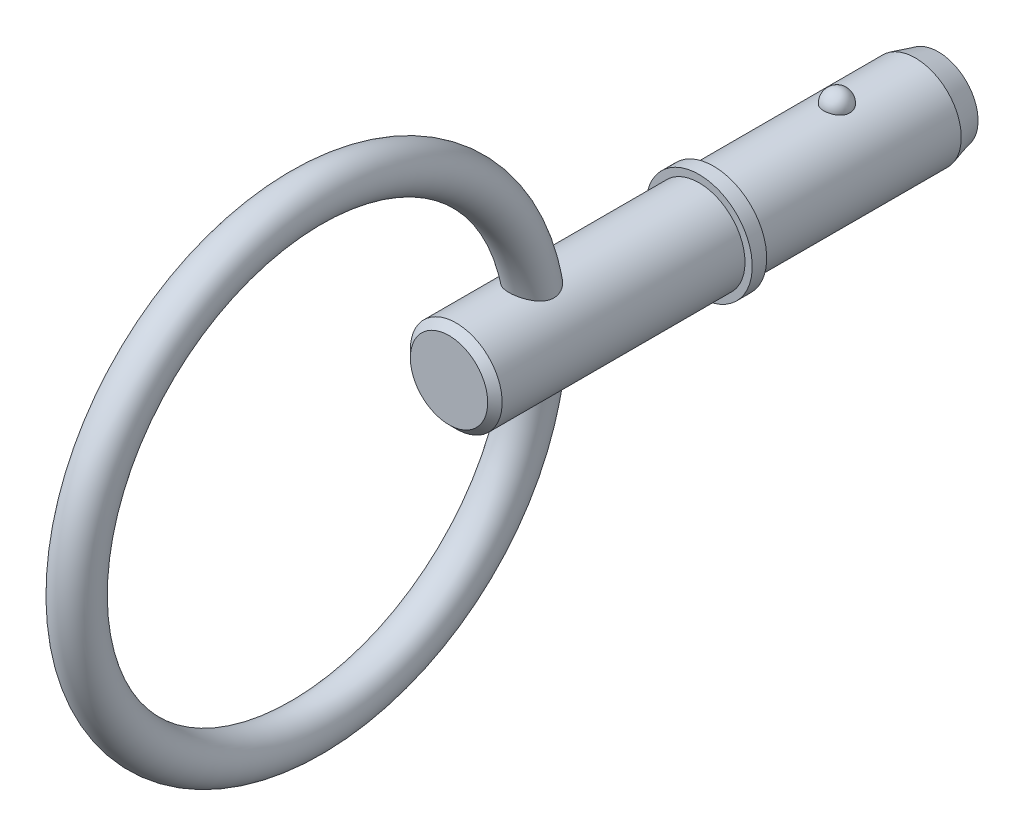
ISO-10303-21;
HEADER;
FILE_DESCRIPTION(('STEP AP214'),'2;1');
FILE_NAME('part.step','',(''),(''),'','','');
FILE_SCHEMA(('AUTOMOTIVE_DESIGN { 1 0 10303 214 1 1 1 1 }'));
ENDSEC;
DATA;
#1=APPLICATION_CONTEXT('core data for automotive mechanical design processes');
#2=APPLICATION_PROTOCOL_DEFINITION('international standard','automotive_design',2000,#1);
#3=PRODUCT_CONTEXT('',#1,'mechanical');
#4=PRODUCT('Part','Part','',(#3));
#5=PRODUCT_RELATED_PRODUCT_CATEGORY('part','',(#4));
#6=PRODUCT_DEFINITION_FORMATION('','',#4);
#7=PRODUCT_DEFINITION_CONTEXT('part definition',#1,'design');
#8=PRODUCT_DEFINITION('design','',#6,#7);
#9=PRODUCT_DEFINITION_SHAPE('','',#8);
#10=(LENGTH_UNIT() NAMED_UNIT(*) SI_UNIT(.MILLI.,.METRE.));
#11=(NAMED_UNIT(*) PLANE_ANGLE_UNIT() SI_UNIT($,.RADIAN.));
#12=(NAMED_UNIT(*) SI_UNIT($,.STERADIAN.) SOLID_ANGLE_UNIT());
#13=UNCERTAINTY_MEASURE_WITH_UNIT(LENGTH_MEASURE(1.E-05),#10,'distance_accuracy_value','');
#14=(GEOMETRIC_REPRESENTATION_CONTEXT(3) GLOBAL_UNCERTAINTY_ASSIGNED_CONTEXT((#13)) GLOBAL_UNIT_ASSIGNED_CONTEXT((#10,
#11,#12)) REPRESENTATION_CONTEXT('',''));
#15=CARTESIAN_POINT('',(0.,0.,0.));
#16=DIRECTION('',(0.,0.,1.));
#17=DIRECTION('',(1.,0.,0.));
#18=AXIS2_PLACEMENT_3D('',#15,#16,#17);
#19=CARTESIAN_POINT('',(0.,0.,7.62));
#20=DIRECTION('',(0.,0.,-1.));
#21=DIRECTION('',(-1.,0.,0.));
#22=AXIS2_PLACEMENT_3D('',#19,#20,#21);
#23=CYLINDRICAL_SURFACE('',#22,3.175);
#24=CARTESIAN_POINT('',(0.90060722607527,3.0445905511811,-0.910000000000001));
#25=CARTESIAN_POINT('',(0.90060646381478,3.04459122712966,-0.859144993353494));
#26=CARTESIAN_POINT('',(0.896466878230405,3.04582460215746,-0.808280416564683));
#27=CARTESIAN_POINT('',(0.88000740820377,3.05062019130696,-0.707994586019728));
#28=CARTESIAN_POINT('',(0.86768478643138,3.05418318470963,-0.658573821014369));
#29=CARTESIAN_POINT('',(0.835170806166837,3.06323316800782,-0.562604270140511));
#30=CARTESIAN_POINT('',(0.814982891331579,3.0687193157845,-0.516054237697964));
#31=CARTESIAN_POINT('',(0.767236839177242,3.08100268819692,-0.427093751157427));
#32=CARTESIAN_POINT('',(0.739678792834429,3.08779989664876,-0.384683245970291));
#33=CARTESIAN_POINT('',(0.677715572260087,3.10198953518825,-0.304951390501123));
#34=CARTESIAN_POINT('',(0.643275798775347,3.10938485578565,-0.267657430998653));
#35=CARTESIAN_POINT('',(0.568522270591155,3.12391647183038,-0.199446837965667));
#36=CARTESIAN_POINT('',(0.528208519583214,3.13105276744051,-0.168530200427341));
#37=CARTESIAN_POINT('',(0.442911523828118,3.14425008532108,-0.114021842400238));
#38=CARTESIAN_POINT('',(0.397942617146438,3.15031426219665,-0.0904084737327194));
#39=CARTESIAN_POINT('',(0.304493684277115,3.16071443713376,-0.051061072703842));
#40=CARTESIAN_POINT('',(0.256014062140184,3.1650506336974,-0.0353261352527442));
#41=CARTESIAN_POINT('',(0.15789136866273,3.17144549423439,-0.0124151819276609));
#42=CARTESIAN_POINT('',(0.108287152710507,3.1735453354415,-0.00508422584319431));
#43=CARTESIAN_POINT('',(0.0085070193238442,3.17538048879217,0.00133254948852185));
#44=CARTESIAN_POINT('',(-0.0416688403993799,3.17511603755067,0.000419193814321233));
#45=CARTESIAN_POINT('',(-0.140377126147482,3.17227395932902,-0.00954840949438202));
#46=CARTESIAN_POINT('',(-0.188922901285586,3.16973088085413,-0.0184810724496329));
#47=CARTESIAN_POINT('',(-0.283780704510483,3.16265029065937,-0.0440659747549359));
#48=CARTESIAN_POINT('',(-0.330092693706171,3.15811274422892,-0.0607183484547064));
#49=CARTESIAN_POINT('',(-0.419493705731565,3.1474895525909,-0.10140675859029));
#50=CARTESIAN_POINT('',(-0.462561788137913,3.14139480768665,-0.125486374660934));
#51=CARTESIAN_POINT('',(-0.54404237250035,3.12831396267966,-0.180346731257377));
#52=CARTESIAN_POINT('',(-0.582454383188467,3.12132776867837,-0.21112817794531));
#53=CARTESIAN_POINT('',(-0.654371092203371,3.10705591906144,-0.279257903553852));
#54=CARTESIAN_POINT('',(-0.687763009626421,3.09976707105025,-0.316724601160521));
#55=CARTESIAN_POINT('',(-0.747869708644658,3.08581767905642,-0.396782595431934));
#56=CARTESIAN_POINT('',(-0.774583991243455,3.07915718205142,-0.43937427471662));
#57=CARTESIAN_POINT('',(-0.820959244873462,3.06712152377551,-0.529074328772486));
#58=CARTESIAN_POINT('',(-0.840531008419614,3.06176288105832,-0.576231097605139));
#59=CARTESIAN_POINT('',(-0.871672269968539,3.0530437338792,-0.673291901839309));
#60=CARTESIAN_POINT('',(-0.883242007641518,3.04968316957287,-0.723195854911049));
#61=CARTESIAN_POINT('',(-0.898057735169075,3.04535343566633,-0.824104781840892));
#62=CARTESIAN_POINT('',(-0.901339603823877,3.04437395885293,-0.875104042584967));
#63=CARTESIAN_POINT('',(-0.89960137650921,3.04488803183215,-0.976947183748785));
#64=CARTESIAN_POINT('',(-0.894581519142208,3.04638151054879,-1.02779106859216));
#65=CARTESIAN_POINT('',(-0.876414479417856,3.051656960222,-1.12760218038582));
#66=CARTESIAN_POINT('',(-0.863310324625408,3.05542681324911,-1.17657789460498));
#67=CARTESIAN_POINT('',(-0.82933491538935,3.06482253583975,-1.27156757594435));
#68=CARTESIAN_POINT('',(-0.808463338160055,3.07044848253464,-1.31758141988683));
#69=CARTESIAN_POINT('',(-0.759325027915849,3.08296842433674,-1.40563218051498));
#70=CARTESIAN_POINT('',(-0.731017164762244,3.08986940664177,-1.44764515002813));
#71=CARTESIAN_POINT('',(-0.667767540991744,3.10415201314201,-1.52624913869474));
#72=CARTESIAN_POINT('',(-0.632825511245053,3.11153365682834,-1.56283993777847));
#73=CARTESIAN_POINT('',(-0.557049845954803,3.12598962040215,-1.62972906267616));
#74=CARTESIAN_POINT('',(-0.516193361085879,3.13306260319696,-1.66000181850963));
#75=CARTESIAN_POINT('',(-0.42979268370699,3.14607829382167,-1.7132172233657));
#76=CARTESIAN_POINT('',(-0.384248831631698,3.15202108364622,-1.73616040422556));
#77=CARTESIAN_POINT('',(-0.290370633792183,3.16204171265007,-1.77380927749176));
#78=CARTESIAN_POINT('',(-0.242079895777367,3.16614263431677,-1.7886174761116));
#79=CARTESIAN_POINT('',(-0.14357928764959,3.17213528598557,-1.81001390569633));
#80=CARTESIAN_POINT('',(-0.0933696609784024,3.1740272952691,-1.81660317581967));
#81=CARTESIAN_POINT('',(0.00648182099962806,3.17537830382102,-1.82132177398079));
#82=CARTESIAN_POINT('',(0.0561153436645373,3.17488455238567,-1.81961539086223));
#83=CARTESIAN_POINT('',(0.154368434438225,3.1716260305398,-1.80816900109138));
#84=CARTESIAN_POINT('',(0.202988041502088,3.16886134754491,-1.79842930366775));
#85=CARTESIAN_POINT('',(0.29764238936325,3.16137318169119,-1.77125024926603));
#86=CARTESIAN_POINT('',(0.343686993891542,3.15665785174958,-1.75384292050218));
#87=CARTESIAN_POINT('',(0.432167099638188,3.14576631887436,-1.71181408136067));
#88=CARTESIAN_POINT('',(0.474602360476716,3.13959001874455,-1.68719209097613));
#89=CARTESIAN_POINT('',(0.555408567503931,3.1263159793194,-1.63094218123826));
#90=CARTESIAN_POINT('',(0.593703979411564,3.11920512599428,-1.59920888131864));
#91=CARTESIAN_POINT('',(0.664472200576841,3.10490064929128,-1.52981493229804));
#92=CARTESIAN_POINT('',(0.696944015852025,3.09770701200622,-1.49215327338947));
#93=CARTESIAN_POINT('',(0.755798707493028,3.08388169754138,-1.41116434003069));
#94=CARTESIAN_POINT('',(0.782059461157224,3.07726269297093,-1.36774610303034));
#95=CARTESIAN_POINT('',(0.827051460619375,3.06547790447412,-1.27699966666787));
#96=CARTESIAN_POINT('',(0.845785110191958,3.06031165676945,-1.22967272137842));
#97=CARTESIAN_POINT('',(0.873798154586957,3.05242388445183,-1.13728658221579));
#98=CARTESIAN_POINT('',(0.883833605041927,3.04951005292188,-1.09247132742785));
#99=CARTESIAN_POINT('',(0.897238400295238,3.0455931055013,-1.00177329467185));
#100=CARTESIAN_POINT('',(0.900607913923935,3.0445899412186,-0.955890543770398));
#101=CARTESIAN_POINT('',(0.90060722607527,3.0445905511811,-0.910000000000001));
#102=B_SPLINE_CURVE_WITH_KNOTS('',3,(#24,#25,#26,#27,#28,#29,#30,#31,#32,#33,#34,#35,#36,#37,
#38,#39,#40,#41,#42,#43,#44,#45,#46,#47,#48,#49,#50,#51,#52,#53,#54,#55,#56,#57,#58,#59,#60,#61,
#62,#63,#64,#65,#66,#67,#68,#69,#70,#71,#72,#73,#74,#75,#76,#77,#78,#79,#80,#81,#82,#83,#84,#85,
#86,#87,#88,#89,#90,#91,#92,#93,#94,#95,#96,#97,#98,#99,#100,#101),.UNSPECIFIED.,.T.,.F.,(4,2,2,
2,2,2,2,2,2,2,2,2,2,2,2,2,2,2,2,2,2,2,2,2,2,2,2,2,2,2,2,2,2,2,2,2,2,2,4),(0.,0.152400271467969,
0.304851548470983,0.45723615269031,0.609618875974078,0.762787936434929,0.915956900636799,
1.06866739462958,1.22136034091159,1.37119044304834,1.52100555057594,1.66858689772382,
1.81617081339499,1.9646377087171,2.1131202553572,2.26455561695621,2.41600229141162,
2.5692805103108,2.72255413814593,2.87516308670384,3.02776764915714,3.1795669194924,
3.33137249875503,3.48403607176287,3.63670583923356,3.78998198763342,3.94324701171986,
4.09453370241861,4.24580126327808,4.39408543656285,4.5423639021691,4.69002878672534,
4.83770349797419,4.9877312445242,5.13778457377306,5.29058018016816,5.44332695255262,
5.58085340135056,5.71837636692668),.UNSPECIFIED.);
#103=CARTESIAN_POINT('',(0.90060722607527,3.0445905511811,-0.910000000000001));
#104=VERTEX_POINT('',#103);
#105=EDGE_CURVE('E102',#104,#104,#102,.T.);
#106=ORIENTED_EDGE('',*,*,#105,.T.);
#107=EDGE_LOOP('',(#106));
#108=FACE_BOUND('',#107,.T.);
#109=CARTESIAN_POINT('',(0.,0.,-6.33399999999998));
#110=DIRECTION('',(0.,0.,-1.));
#111=DIRECTION('',(-1.,0.,0.));
#112=AXIS2_PLACEMENT_3D('',#109,#110,#111);
#113=CIRCLE('',#112,3.175);
#114=CARTESIAN_POINT('',(-3.175,0.,-6.33399999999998));
#115=VERTEX_POINT('',#114);
#116=EDGE_CURVE('E109',#115,#115,#113,.F.);
#117=ORIENTED_EDGE('',*,*,#116,.T.);
#118=EDGE_LOOP('',(#117));
#119=FACE_BOUND('',#118,.T.);
#120=CARTESIAN_POINT('',(0.,0.,7.62));
#121=DIRECTION('',(0.,0.,1.));
#122=DIRECTION('',(1.,0.,0.));
#123=AXIS2_PLACEMENT_3D('',#120,#121,#122);
#124=CIRCLE('',#123,3.175);
#125=CARTESIAN_POINT('',(3.175,0.,7.62));
#126=VERTEX_POINT('',#125);
#127=EDGE_CURVE('E107',#126,#126,#124,.T.);
#128=ORIENTED_EDGE('',*,*,#127,.F.);
#129=EDGE_LOOP('',(#128));
#130=FACE_BOUND('',#129,.T.);
#131=ADVANCED_FACE('F39',(#108,#119,#130),#23,.T.);
#132=CARTESIAN_POINT('',(0.,0.,-7.92));
#133=DIRECTION('',(0.,0.,-1.));
#134=DIRECTION('',(-1.,0.,0.));
#135=AXIS2_PLACEMENT_3D('',#132,#133,#134);
#136=PLANE('',#135);
#137=CARTESIAN_POINT('',(0.,0.,-7.92));
#138=DIRECTION('',(0.,0.,-1.));
#139=DIRECTION('',(-1.,0.,0.));
#140=AXIS2_PLACEMENT_3D('',#137,#138,#139);
#141=CIRCLE('',#140,2.75003258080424);
#142=CARTESIAN_POINT('',(-2.75003258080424,0.,-7.92));
#143=VERTEX_POINT('',#142);
#144=EDGE_CURVE('E142',#143,#143,#141,.T.);
#145=ORIENTED_EDGE('',*,*,#144,.T.);
#146=EDGE_LOOP('',(#145));
#147=FACE_BOUND('',#146,.T.);
#148=ADVANCED_FACE('F88',(#147),#136,.T.);
#149=CARTESIAN_POINT('',(0.,0.,-7.92));
#150=DIRECTION('',(0.,0.,1.));
#151=DIRECTION('',(1.,0.,0.));
#152=AXIS2_PLACEMENT_3D('',#149,#150,#151);
#153=CONICAL_SURFACE('',#152,2.75003258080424,0.261799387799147);
#154=ORIENTED_EDGE('',*,*,#116,.F.);
#155=EDGE_LOOP('',(#154));
#156=FACE_BOUND('',#155,.T.);
#157=ORIENTED_EDGE('',*,*,#144,.F.);
#158=EDGE_LOOP('',(#157));
#159=FACE_BOUND('',#158,.T.);
#160=ADVANCED_FACE('F94',(#156,#159),#153,.T.);
#161=CARTESIAN_POINT('',(0.,3.175,-0.910000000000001));
#162=DIRECTION('',(0.,1.,0.));
#163=DIRECTION('',(0.,0.,-1.));
#164=AXIS2_PLACEMENT_3D('',#161,#162,#163);
#165=SPHERICAL_SURFACE('',#164,0.91);
#166=ORIENTED_EDGE('',*,*,#105,.F.);
#167=EDGE_LOOP('',(#166));
#168=FACE_BOUND('',#167,.T.);
#169=ADVANCED_FACE('F112',(#168),#165,.T.);
#170=CARTESIAN_POINT('',(0.,0.,7.62));
#171=DIRECTION('',(0.,0.,-1.));
#172=DIRECTION('',(-1.,0.,0.));
#173=AXIS2_PLACEMENT_3D('',#170,#171,#172);
#174=PLANE('',#173);
#175=ORIENTED_EDGE('',*,*,#127,.T.);
#176=EDGE_LOOP('',(#175));
#177=FACE_BOUND('',#176,.T.);
#178=CARTESIAN_POINT('',(0.,0.,7.62));
#179=DIRECTION('',(0.,0.,-1.));
#180=DIRECTION('',(-1.,0.,0.));
#181=AXIS2_PLACEMENT_3D('',#178,#179,#180);
#182=CIRCLE('',#181,3.675);
#183=CARTESIAN_POINT('',(-3.675,0.,7.62));
#184=VERTEX_POINT('',#183);
#185=EDGE_CURVE('E108',#184,#184,#182,.T.);
#186=ORIENTED_EDGE('',*,*,#185,.T.);
#187=EDGE_LOOP('',(#186));
#188=FACE_BOUND('',#187,.T.);
#189=ADVANCED_FACE('F116',(#177,#188),#174,.T.);
#190=CARTESIAN_POINT('',(0.,0.,33.7287874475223));
#191=DIRECTION('',(0.,0.,-1.));
#192=DIRECTION('',(-1.,0.,0.));
#193=AXIS2_PLACEMENT_3D('',#190,#191,#192);
#194=CYLINDRICAL_SURFACE('',#193,3.675);
#195=CARTESIAN_POINT('',(0.,0.,8.62));
#196=DIRECTION('',(0.,0.,-1.));
#197=DIRECTION('',(-1.,0.,0.));
#198=AXIS2_PLACEMENT_3D('',#195,#196,#197);
#199=CIRCLE('',#198,3.675);
#200=CARTESIAN_POINT('',(-3.675,0.,8.62));
#201=VERTEX_POINT('',#200);
#202=EDGE_CURVE('E133',#201,#201,#199,.T.);
#203=ORIENTED_EDGE('',*,*,#202,.T.);
#204=EDGE_LOOP('',(#203));
#205=FACE_BOUND('',#204,.T.);
#206=ORIENTED_EDGE('',*,*,#185,.F.);
#207=EDGE_LOOP('',(#206));
#208=FACE_BOUND('',#207,.T.);
#209=ADVANCED_FACE('F120',(#205,#208),#194,.T.);
#210=CARTESIAN_POINT('',(0.,3.675,8.62));
#211=DIRECTION('',(0.,0.,1.));
#212=DIRECTION('',(1.,0.,0.));
#213=AXIS2_PLACEMENT_3D('',#210,#211,#212);
#214=PLANE('',#213);
#215=CARTESIAN_POINT('',(0.,0.,8.62));
#216=DIRECTION('',(0.,0.,1.));
#217=DIRECTION('',(1.,0.,0.));
#218=AXIS2_PLACEMENT_3D('',#215,#216,#217);
#219=CIRCLE('',#218,3.175);
#220=CARTESIAN_POINT('',(3.175,0.,8.62));
#221=VERTEX_POINT('',#220);
#222=EDGE_CURVE('E111',#221,#221,#219,.T.);
#223=ORIENTED_EDGE('',*,*,#222,.F.);
#224=EDGE_LOOP('',(#223));
#225=FACE_BOUND('',#224,.T.);
#226=ORIENTED_EDGE('',*,*,#202,.F.);
#227=EDGE_LOOP('',(#226));
#228=FACE_BOUND('',#227,.T.);
#229=ADVANCED_FACE('F85',(#225,#228),#214,.T.);
#230=CARTESIAN_POINT('',(0.,0.,25.91));
#231=DIRECTION('',(0.,0.,-1.));
#232=DIRECTION('',(-1.,0.,0.));
#233=AXIS2_PLACEMENT_3D('',#230,#231,#232);
#234=CYLINDRICAL_SURFACE('',#233,3.175);
#235=CARTESIAN_POINT('',(-0.793622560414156,-3.07421343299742,18.9149618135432));
#236=CARTESIAN_POINT('',(-0.723928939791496,-3.09220199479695,18.8740743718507));
#237=CARTESIAN_POINT('',(-0.65053758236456,-3.10860299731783,18.8386572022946));
#238=CARTESIAN_POINT('',(-0.498225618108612,-3.13662262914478,18.77960803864));
#239=CARTESIAN_POINT('',(-0.419299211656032,-3.14823615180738,18.755988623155));
#240=CARTESIAN_POINT('',(-0.258022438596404,-3.16553731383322,18.7211787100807));
#241=CARTESIAN_POINT('',(-0.17566885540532,-3.17121924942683,18.7100001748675));
#242=CARTESIAN_POINT('',(-0.0100583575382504,-3.17606405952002,18.7004538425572));
#243=CARTESIAN_POINT('',(0.073198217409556,-3.17522930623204,18.7020813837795));
#244=CARTESIAN_POINT('',(0.236345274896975,-3.16722178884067,18.7179075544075));
#245=CARTESIAN_POINT('',(0.316269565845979,-3.16018772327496,18.7318310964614));
#246=CARTESIAN_POINT('',(0.472429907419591,-3.14064183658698,18.7714871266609));
#247=CARTESIAN_POINT('',(0.548665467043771,-3.12812928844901,18.7972211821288));
#248=CARTESIAN_POINT('',(0.696533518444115,-3.0985857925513,18.8603145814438));
#249=CARTESIAN_POINT('',(0.768085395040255,-3.08149328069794,18.8978336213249));
#250=CARTESIAN_POINT('',(0.903666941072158,-3.04449595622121,18.983584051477));
#251=CARTESIAN_POINT('',(0.967693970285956,-3.02459016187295,19.0318191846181));
#252=CARTESIAN_POINT('',(1.08889306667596,-2.98315111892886,19.140085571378));
#253=CARTESIAN_POINT('',(1.14572430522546,-2.96158491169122,19.2004869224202));
#254=CARTESIAN_POINT('',(1.24806454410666,-2.91993487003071,19.3306874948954));
#255=CARTESIAN_POINT('',(1.29357550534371,-2.89985077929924,19.4004850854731));
#256=CARTESIAN_POINT('',(1.37094214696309,-2.86407549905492,19.5462600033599));
#257=CARTESIAN_POINT('',(1.40307792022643,-2.84829687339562,19.6220662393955));
#258=CARTESIAN_POINT('',(1.45397574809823,-2.82265933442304,19.7789553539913));
#259=CARTESIAN_POINT('',(1.47274938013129,-2.81279529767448,19.8600335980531));
#260=CARTESIAN_POINT('',(1.49549698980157,-2.80076108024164,20.0179026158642));
#261=CARTESIAN_POINT('',(1.50056337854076,-2.79802369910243,20.0944958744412));
#262=CARTESIAN_POINT('',(1.49933665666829,-2.79868066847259,20.2475541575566));
#263=CARTESIAN_POINT('',(1.49304097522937,-2.80207640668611,20.3240191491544));
#264=CARTESIAN_POINT('',(1.46976618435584,-2.81435249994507,20.4752802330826));
#265=CARTESIAN_POINT('',(1.45272287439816,-2.82326580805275,20.5500634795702));
#266=CARTESIAN_POINT('',(1.40884990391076,-2.84541139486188,20.6960088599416));
#267=CARTESIAN_POINT('',(1.38201642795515,-2.85864535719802,20.7671695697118));
#268=CARTESIAN_POINT('',(1.31496449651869,-2.89016475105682,20.9146079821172));
#269=CARTESIAN_POINT('',(1.27338339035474,-2.90890132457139,20.9901693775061));
#270=CARTESIAN_POINT('',(1.17952729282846,-2.94820796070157,21.1339034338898));
#271=CARTESIAN_POINT('',(1.12723913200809,-2.96878026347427,21.2020668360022));
#272=CARTESIAN_POINT('',(1.00570728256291,-3.01228109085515,21.3373106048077));
#273=CARTESIAN_POINT('',(0.935174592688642,-3.03519170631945,21.4032498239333));
#274=CARTESIAN_POINT('',(0.782605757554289,-3.07805054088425,21.521321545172));
#275=CARTESIAN_POINT('',(0.700588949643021,-3.09800362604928,21.5734768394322));
#276=CARTESIAN_POINT('',(0.549003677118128,-3.12787153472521,21.6496423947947));
#277=CARTESIAN_POINT('',(0.48158225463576,-3.1390487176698,21.6774376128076));
#278=CARTESIAN_POINT('',(0.34269622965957,-3.15722518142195,21.7221563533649));
#279=CARTESIAN_POINT('',(0.271235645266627,-3.16422853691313,21.7390904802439));
#280=CARTESIAN_POINT('',(0.125873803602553,-3.17334230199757,21.7610622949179));
#281=CARTESIAN_POINT('',(0.0519637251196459,-3.17543249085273,21.7660508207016));
#282=CARTESIAN_POINT('',(-0.0956207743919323,-3.17441743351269,21.7636180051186));
#283=CARTESIAN_POINT('',(-0.16929518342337,-3.1713119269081,21.7561960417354));
#284=CARTESIAN_POINT('',(-0.30944934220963,-3.1606169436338,21.7303375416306));
#285=CARTESIAN_POINT('',(-0.376089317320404,-3.15332372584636,21.7126279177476));
#286=CARTESIAN_POINT('',(-0.505583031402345,-3.13517004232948,21.6677876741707));
#287=CARTESIAN_POINT('',(-0.568435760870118,-3.12430863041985,21.6406545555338));
#288=CARTESIAN_POINT('',(-0.694306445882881,-3.09887452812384,21.5755626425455));
#289=CARTESIAN_POINT('',(-0.756907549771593,-3.08406907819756,21.5368937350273));
#290=CARTESIAN_POINT('',(-0.8756456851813,-3.05248288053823,21.4513455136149));
#291=CARTESIAN_POINT('',(-0.931779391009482,-3.03570112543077,21.4044620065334));
#292=CARTESIAN_POINT('',(-1.0463923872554,-2.99832170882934,21.2947926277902));
#293=CARTESIAN_POINT('',(-1.10353654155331,-2.97757338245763,21.2306605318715));
#294=CARTESIAN_POINT('',(-1.20755858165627,-2.93692907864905,21.0942268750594));
#295=CARTESIAN_POINT('',(-1.25442453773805,-2.91703411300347,21.0219159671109));
#296=CARTESIAN_POINT('',(-1.34199791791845,-2.87788786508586,20.8612794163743));
#297=CARTESIAN_POINT('',(-1.38127718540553,-2.8590047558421,20.7720744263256));
#298=CARTESIAN_POINT('',(-1.44406659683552,-2.82781619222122,20.5871839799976));
#299=CARTESIAN_POINT('',(-1.46759319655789,-2.81550387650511,20.4915054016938));
#300=CARTESIAN_POINT('',(-1.49571801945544,-2.8006591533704,20.3045771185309));
#301=CARTESIAN_POINT('',(-1.50169726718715,-2.79741422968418,20.213598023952));
#302=CARTESIAN_POINT('',(-1.49747735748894,-2.79967890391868,20.0321564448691));
#303=CARTESIAN_POINT('',(-1.48729863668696,-2.80517744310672,19.9416934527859));
#304=CARTESIAN_POINT('',(-1.45348639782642,-2.82281521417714,19.7784626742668));
#305=CARTESIAN_POINT('',(-1.43212237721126,-2.83382344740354,19.705088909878));
#306=CARTESIAN_POINT('',(-1.37828411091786,-2.86039426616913,19.5633903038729));
#307=CARTESIAN_POINT('',(-1.34580440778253,-2.87595908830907,19.4950679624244));
#308=CARTESIAN_POINT('',(-1.27066760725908,-2.90993532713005,19.3650336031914));
#309=CARTESIAN_POINT('',(-1.22800357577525,-2.9283486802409,19.303326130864));
#310=CARTESIAN_POINT('',(-1.13363307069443,-2.96615489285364,19.1877083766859));
#311=CARTESIAN_POINT('',(-1.08193541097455,-2.98554678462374,19.1337905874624));
#312=CARTESIAN_POINT('',(-0.990573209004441,-3.01675653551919,19.0523094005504));
#313=CARTESIAN_POINT('',(-0.953209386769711,-3.02880489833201,19.0222130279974));
#314=CARTESIAN_POINT('',(-0.875544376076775,-3.05216210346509,18.9657477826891));
#315=CARTESIAN_POINT('',(-0.835242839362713,-3.06347085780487,18.9393793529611));
#316=CARTESIAN_POINT('',(-0.793622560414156,-3.07421343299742,18.9149618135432));
#317=B_SPLINE_CURVE_WITH_KNOTS('',3,(#235,#236,#237,#238,#239,#240,#241,#242,#243,#244,#245,
#246,#247,#248,#249,#250,#251,#252,#253,#254,#255,#256,#257,#258,#259,#260,#261,#262,#263,#264,
#265,#266,#267,#268,#269,#270,#271,#272,#273,#274,#275,#276,#277,#278,#279,#280,#281,#282,#283,
#284,#285,#286,#287,#288,#289,#290,#291,#292,#293,#294,#295,#296,#297,#298,#299,#300,#301,#302,
#303,#304,#305,#306,#307,#308,#309,#310,#311,#312,#313,#314,#315,#316),.UNSPECIFIED.,.T.,.F.,(4,
2,2,2,2,2,2,2,2,2,2,2,2,2,2,2,2,2,2,2,2,2,2,2,2,2,2,2,2,2,2,2,2,2,2,2,2,2,2,2,4),(0.,
0.248167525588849,0.496599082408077,0.745269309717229,0.993849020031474,1.23700449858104,
1.48019225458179,1.72682894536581,1.97355191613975,2.22939388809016,2.48519151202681,
2.73532416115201,2.98523982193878,3.21455414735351,3.4439203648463,3.67466984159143,
3.90550934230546,4.16925064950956,4.43331832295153,4.72951976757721,5.02522832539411,
5.24564983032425,5.46585579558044,5.68696647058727,5.9080882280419,6.11521387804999,
6.32239449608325,6.54672206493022,6.77116447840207,7.03522663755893,7.29959368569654,
7.59590092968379,7.89189815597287,8.16387683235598,8.43551178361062,8.66603557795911,
8.89667271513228,9.12746733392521,9.35803801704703,9.5062233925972,9.65442636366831),.UNSPECIFIED.);
#318=CARTESIAN_POINT('',(-0.793622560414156,-3.07421343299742,18.9149618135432));
#319=VERTEX_POINT('',#318);
#320=EDGE_CURVE('E10',#319,#319,#317,.T.);
#321=ORIENTED_EDGE('',*,*,#320,.F.);
#322=EDGE_LOOP('',(#321));
#323=FACE_BOUND('',#322,.T.);
#324=CARTESIAN_POINT('',(-0.793622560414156,3.07421343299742,18.9149618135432));
#325=CARTESIAN_POINT('',(-0.864606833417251,3.05588589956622,18.9566128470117));
#326=CARTESIAN_POINT('',(-0.931875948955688,3.03587991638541,19.0040114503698));
#327=CARTESIAN_POINT('',(-1.05725170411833,2.99453227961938,19.1093775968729));
#328=CARTESIAN_POINT('',(-1.11534118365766,2.97318822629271,19.1673645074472));
#329=CARTESIAN_POINT('',(-1.22080462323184,2.93146441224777,19.292887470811));
#330=CARTESIAN_POINT('',(-1.26816209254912,2.91108617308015,19.3604379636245));
#331=CARTESIAN_POINT('',(-1.35052787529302,2.87380473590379,19.5035086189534));
#332=CARTESIAN_POINT('',(-1.38554886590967,2.856897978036,19.5790204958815));
#333=CARTESIAN_POINT('',(-1.44074287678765,2.82945202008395,19.7322947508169));
#334=CARTESIAN_POINT('',(-1.46153301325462,2.81865228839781,19.8097872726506));
#335=CARTESIAN_POINT('',(-1.49023441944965,2.80358650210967,19.9677206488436));
#336=CARTESIAN_POINT('',(-1.49815016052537,2.79931817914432,20.0481604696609));
#337=CARTESIAN_POINT('',(-1.50117056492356,2.79769676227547,20.2040076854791));
#338=CARTESIAN_POINT('',(-1.49708260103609,2.79990784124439,20.2793985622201));
#339=CARTESIAN_POINT('',(-1.47846985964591,2.80977909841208,20.4284983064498));
#340=CARTESIAN_POINT('',(-1.46394166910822,2.8174410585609,20.5022066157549));
#341=CARTESIAN_POINT('',(-1.42400377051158,2.83784609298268,20.6513443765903));
#342=CARTESIAN_POINT('',(-1.39791960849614,2.85090002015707,20.7265484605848));
#343=CARTESIAN_POINT('',(-1.33585690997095,2.8805017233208,20.8720384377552));
#344=CARTESIAN_POINT('',(-1.29987052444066,2.89705226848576,20.9423203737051));
#345=CARTESIAN_POINT('',(-1.21229019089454,2.93489412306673,21.0877405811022));
#346=CARTESIAN_POINT('',(-1.15911759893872,2.95651988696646,21.1618449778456));
#347=CARTESIAN_POINT('',(-1.04143166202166,2.99999612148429,21.3003805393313));
#348=CARTESIAN_POINT('',(-0.976918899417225,3.0218465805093,21.364812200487));
#349=CARTESIAN_POINT('',(-0.845368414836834,3.06106710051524,21.4752302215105));
#350=CARTESIAN_POINT('',(-0.779466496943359,3.0786636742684,21.5224840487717));
#351=CARTESIAN_POINT('',(-0.640261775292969,3.11059085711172,21.6059540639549));
#352=CARTESIAN_POINT('',(-0.566963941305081,3.12492363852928,21.6421775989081));
#353=CARTESIAN_POINT('',(-0.413802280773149,3.14887886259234,21.7018109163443));
#354=CARTESIAN_POINT('',(-0.333888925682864,3.15846114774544,21.7251116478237));
#355=CARTESIAN_POINT('',(-0.17066058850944,3.17146222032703,21.7565717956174));
#356=CARTESIAN_POINT('',(-0.087349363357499,3.17488763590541,21.7647474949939));
#357=CARTESIAN_POINT('',(0.0674621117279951,3.17509166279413,21.7652317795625));
#358=CARTESIAN_POINT('',(0.138963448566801,3.17274321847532,21.7596242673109));
#359=CARTESIAN_POINT('',(0.279855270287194,3.16342998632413,21.7371581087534));
#360=CARTESIAN_POINT('',(0.349245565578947,3.15646478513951,21.7202984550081));
#361=CARTESIAN_POINT('',(0.483013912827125,3.13875920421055,21.6767119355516));
#362=CARTESIAN_POINT('',(0.547455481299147,3.12808257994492,21.6501513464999));
#363=CARTESIAN_POINT('',(0.671431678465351,3.10383639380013,21.5883782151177));
#364=CARTESIAN_POINT('',(0.730964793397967,3.09026594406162,21.5531630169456));
#365=CARTESIAN_POINT('',(0.852308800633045,3.05919023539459,21.4698716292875));
#366=CARTESIAN_POINT('',(0.913284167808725,3.04140021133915,21.4206877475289));
#367=CARTESIAN_POINT('',(1.0273242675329,3.00480015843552,21.3141850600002));
#368=CARTESIAN_POINT('',(1.08038247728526,2.98598930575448,21.2568596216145));
#369=CARTESIAN_POINT('',(1.18657794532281,2.94557646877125,21.1246952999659));
#370=CARTESIAN_POINT('',(1.23812372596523,2.92405810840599,21.0485445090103));
#371=CARTESIAN_POINT('',(1.32862928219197,2.88406370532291,20.8882796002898));
#372=CARTESIAN_POINT('',(1.36758013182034,2.86558982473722,20.8041598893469));
#373=CARTESIAN_POINT('',(1.43274280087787,2.83359383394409,20.6261421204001));
#374=CARTESIAN_POINT('',(1.45837682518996,2.82030175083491,20.5319863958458));
#375=CARTESIAN_POINT('',(1.49241322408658,2.80245006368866,20.3398495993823));
#376=CARTESIAN_POINT('',(1.50084951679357,2.79787327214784,20.2418764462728));
#377=CARTESIAN_POINT('',(1.49914798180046,2.79877932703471,20.0605073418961));
#378=CARTESIAN_POINT('',(1.49154990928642,2.80288682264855,19.977078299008));
#379=CARTESIAN_POINT('',(1.4625313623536,2.81813655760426,19.8133228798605));
#380=CARTESIAN_POINT('',(1.44111368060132,2.82927737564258,19.7329958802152));
#381=CARTESIAN_POINT('',(1.38785163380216,2.85574398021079,19.5857200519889));
#382=CARTESIAN_POINT('',(1.3572264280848,2.87055627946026,19.5182302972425));
#383=CARTESIAN_POINT('',(1.28612163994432,2.90310901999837,19.3894446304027));
#384=CARTESIAN_POINT('',(1.24564038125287,2.92084995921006,19.328149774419));
#385=CARTESIAN_POINT('',(1.1532082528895,2.95860856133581,19.2094756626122));
#386=CARTESIAN_POINT('',(1.10072548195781,2.97869868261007,19.1525343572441));
#387=CARTESIAN_POINT('',(0.987118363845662,3.01825121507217,19.0477702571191));
#388=CARTESIAN_POINT('',(0.925990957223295,3.03771340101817,18.9999507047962));
#389=CARTESIAN_POINT('',(0.792065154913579,3.07545294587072,18.9113571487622));
#390=CARTESIAN_POINT('',(0.718757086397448,3.0935612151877,18.8712781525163));
#391=CARTESIAN_POINT('',(0.565747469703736,3.12516438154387,18.8033730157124));
#392=CARTESIAN_POINT('',(0.486046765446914,3.13865988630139,18.7755452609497));
#393=CARTESIAN_POINT('',(0.323293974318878,3.15955163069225,18.7330890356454));
#394=CARTESIAN_POINT('',(0.240283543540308,3.16700771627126,18.7183309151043));
#395=CARTESIAN_POINT('',(0.0726303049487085,3.17527774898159,18.7019853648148));
#396=CARTESIAN_POINT('',(-0.0120126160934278,3.17609123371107,18.7003988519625));
#397=CARTESIAN_POINT('',(-0.177340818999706,3.17108555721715,18.7102649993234));
#398=CARTESIAN_POINT('',(-0.258061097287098,3.16549698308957,18.7212643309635));
#399=CARTESIAN_POINT('',(-0.416230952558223,3.1486007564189,18.7552506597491));
#400=CARTESIAN_POINT('',(-0.493684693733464,3.13730063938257,18.7782218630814));
#401=CARTESIAN_POINT('',(-0.607599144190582,3.11657538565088,18.8218364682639));
#402=CARTESIAN_POINT('',(-0.645999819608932,3.10882447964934,18.8383691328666));
#403=CARTESIAN_POINT('',(-0.721122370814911,3.092262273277,18.8744352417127));
#404=CARTESIAN_POINT('',(-0.757844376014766,3.08345105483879,18.8939684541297));
#405=CARTESIAN_POINT('',(-0.793622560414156,3.07421343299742,18.9149618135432));
#406=B_SPLINE_CURVE_WITH_KNOTS('',3,(#324,#325,#326,#327,#328,#329,#330,#331,#332,#333,#334,
#335,#336,#337,#338,#339,#340,#341,#342,#343,#344,#345,#346,#347,#348,#349,#350,#351,#352,#353,
#354,#355,#356,#357,#358,#359,#360,#361,#362,#363,#364,#365,#366,#367,#368,#369,#370,#371,#372,
#373,#374,#375,#376,#377,#378,#379,#380,#381,#382,#383,#384,#385,#386,#387,#388,#389,#390,#391,
#392,#393,#394,#395,#396,#397,#398,#399,#400,#401,#402,#403,#404,#405),.UNSPECIFIED.,.T.,.F.,(4,
2,2,2,2,2,2,2,2,2,2,2,2,2,2,2,2,2,2,2,2,2,2,2,2,2,2,2,2,2,2,2,2,2,2,2,2,2,2,2,4),(0.,
0.252800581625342,0.506068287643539,0.759722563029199,1.01311541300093,1.25467278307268,
1.49614624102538,1.7217579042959,1.94744335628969,2.18851823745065,2.4297847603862,
2.7098131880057,2.98982723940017,3.23776482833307,3.48553690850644,3.73536921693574,
3.98493240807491,4.19913817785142,4.4133631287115,4.62407643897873,4.83485449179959,
5.07495869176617,5.31525962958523,5.59735778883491,5.87965543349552,6.17335015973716,
6.46646508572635,6.71664398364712,6.96677234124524,7.19253107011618,7.41832822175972,
7.6573166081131,7.89638978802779,8.15162793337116,8.40683243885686,8.65947601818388,
8.91213718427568,9.15597668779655,9.39949531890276,9.5269241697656,9.65434318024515),.UNSPECIFIED.);
#407=CARTESIAN_POINT('',(-0.793622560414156,3.07421343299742,18.9149618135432));
#408=VERTEX_POINT('',#407);
#409=EDGE_CURVE('E51',#408,#408,#406,.T.);
#410=ORIENTED_EDGE('',*,*,#409,.F.);
#411=EDGE_LOOP('',(#410));
#412=FACE_BOUND('',#411,.T.);
#413=CARTESIAN_POINT('',(0.,0.,25.41));
#414=DIRECTION('',(0.,0.,-1.));
#415=DIRECTION('',(-1.,0.,0.));
#416=AXIS2_PLACEMENT_3D('',#413,#414,#415);
#417=CIRCLE('',#416,3.175);
#418=CARTESIAN_POINT('',(-3.175,0.,25.41));
#419=VERTEX_POINT('',#418);
#420=EDGE_CURVE('E64',#419,#419,#417,.T.);
#421=ORIENTED_EDGE('',*,*,#420,.T.);
#422=EDGE_LOOP('',(#421));
#423=FACE_BOUND('',#422,.T.);
#424=ORIENTED_EDGE('',*,*,#222,.T.);
#425=EDGE_LOOP('',(#424));
#426=FACE_BOUND('',#425,.T.);
#427=ADVANCED_FACE('F69',(#323,#412,#423,#426),#234,.T.);
#428=CARTESIAN_POINT('',(0.,0.,25.91));
#429=DIRECTION('',(0.,0.,-1.));
#430=DIRECTION('',(-1.,0.,0.));
#431=AXIS2_PLACEMENT_3D('',#428,#429,#430);
#432=PLANE('',#431);
#433=CARTESIAN_POINT('',(0.,0.,25.91));
#434=DIRECTION('',(0.,0.,-1.));
#435=DIRECTION('',(-1.,0.,0.));
#436=AXIS2_PLACEMENT_3D('',#433,#434,#435);
#437=CIRCLE('',#436,2.675);
#438=CARTESIAN_POINT('',(-2.675,0.,25.91));
#439=VERTEX_POINT('',#438);
#440=EDGE_CURVE('E58',#439,#439,#437,.F.);
#441=ORIENTED_EDGE('',*,*,#440,.T.);
#442=EDGE_LOOP('',(#441));
#443=FACE_BOUND('',#442,.T.);
#444=ADVANCED_FACE('F76',(#443),#432,.F.);
#445=CARTESIAN_POINT('',(0.,0.,25.41));
#446=DIRECTION('',(0.,0.,-1.));
#447=DIRECTION('',(-1.,0.,0.));
#448=AXIS2_PLACEMENT_3D('',#445,#446,#447);
#449=CONICAL_SURFACE('',#448,3.175,0.785398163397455);
#450=ORIENTED_EDGE('',*,*,#440,.F.);
#451=EDGE_LOOP('',(#450));
#452=FACE_BOUND('',#451,.T.);
#453=ORIENTED_EDGE('',*,*,#420,.F.);
#454=EDGE_LOOP('',(#453));
#455=FACE_BOUND('',#454,.T.);
#456=ADVANCED_FACE('F41',(#452,#455),#449,.T.);
#457=CARTESIAN_POINT('',(0.,0.,35.785));
#458=DIRECTION('',(1.,0.,0.));
#459=DIRECTION('',(0.,0.,-1.));
#460=AXIS2_PLACEMENT_3D('',#457,#458,#459);
#461=TOROIDAL_SURFACE('',#460,15.875,1.5);
#462=ORIENTED_EDGE('',*,*,#320,.T.);
#463=EDGE_LOOP('',(#462));
#464=FACE_BOUND('',#463,.T.);
#465=ORIENTED_EDGE('',*,*,#409,.T.);
#466=EDGE_LOOP('',(#465));
#467=FACE_BOUND('',#466,.T.);
#468=ADVANCED_FACE('F73',(#464,#467),#461,.T.);
#469=CLOSED_SHELL('',(#131,#148,#160,#169,#189,#209,#229,#427,#444,#456,#468));
#470=MANIFOLD_SOLID_BREP('B2',#469);
#471=ADVANCED_BREP_SHAPE_REPRESENTATION('',(#18,#470),#14);
#472=SHAPE_DEFINITION_REPRESENTATION(#9,#471);
ENDSEC;
END-ISO-10303-21;
